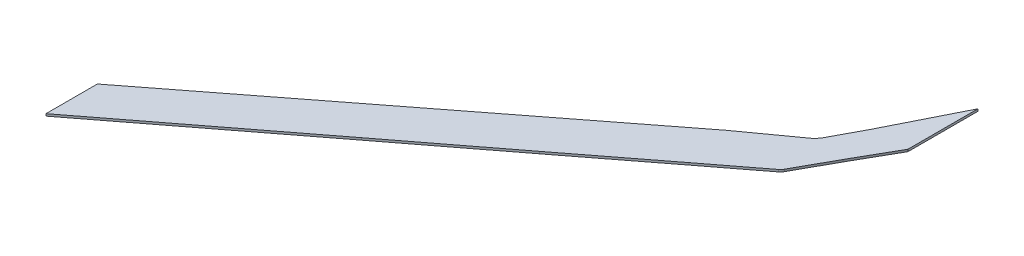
ISO-10303-21;
HEADER;
FILE_DESCRIPTION(('STEP AP214'),'2;1');
FILE_NAME('part.step','',(''),(''),'','','');
FILE_SCHEMA(('AUTOMOTIVE_DESIGN { 1 0 10303 214 1 1 1 1 }'));
ENDSEC;
DATA;
#1=APPLICATION_CONTEXT('core data for automotive mechanical design processes');
#2=APPLICATION_PROTOCOL_DEFINITION('international standard','automotive_design',2000,#1);
#3=PRODUCT_CONTEXT('',#1,'mechanical');
#4=PRODUCT('Part','Part','',(#3));
#5=PRODUCT_RELATED_PRODUCT_CATEGORY('part','',(#4));
#6=PRODUCT_DEFINITION_FORMATION('','',#4);
#7=PRODUCT_DEFINITION_CONTEXT('part definition',#1,'design');
#8=PRODUCT_DEFINITION('design','',#6,#7);
#9=PRODUCT_DEFINITION_SHAPE('','',#8);
#10=(LENGTH_UNIT() NAMED_UNIT(*) SI_UNIT(.MILLI.,.METRE.));
#11=(NAMED_UNIT(*) PLANE_ANGLE_UNIT() SI_UNIT($,.RADIAN.));
#12=(NAMED_UNIT(*) SI_UNIT($,.STERADIAN.) SOLID_ANGLE_UNIT());
#13=UNCERTAINTY_MEASURE_WITH_UNIT(LENGTH_MEASURE(1.E-05),#10,'distance_accuracy_value','');
#14=(GEOMETRIC_REPRESENTATION_CONTEXT(3) GLOBAL_UNCERTAINTY_ASSIGNED_CONTEXT((#13)) GLOBAL_UNIT_ASSIGNED_CONTEXT((#10,
#11,#12)) REPRESENTATION_CONTEXT('',''));
#15=CARTESIAN_POINT('',(0.,0.,0.));
#16=DIRECTION('',(0.,0.,1.));
#17=DIRECTION('',(1.,0.,0.));
#18=AXIS2_PLACEMENT_3D('',#15,#16,#17);
#19=CARTESIAN_POINT('',(835.042000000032,-839.999983,2312.319994));
#20=DIRECTION('',(-0.607742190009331,0.,-0.794134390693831));
#21=DIRECTION('',(-0.794134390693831,0.,0.607742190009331));
#22=AXIS2_PLACEMENT_3D('',#19,#20,#21);
#23=PLANE('',#22);
#24=DIRECTION('',(-0.794134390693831,0.,0.607742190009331));
#25=VECTOR('',#24,1.);
#26=CARTESIAN_POINT('',(835.042000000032,-829.999983,2312.319994));
#27=LINE('',#26,#25);
#28=CARTESIAN_POINT('',(1300.50802200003,-829.999983,1956.10404));
#29=VERTEX_POINT('',#28);
#30=CARTESIAN_POINT('',(835.042000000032,-829.999983,2312.319994));
#31=VERTEX_POINT('',#30);
#32=EDGE_CURVE('E215',#29,#31,#27,.T.);
#33=ORIENTED_EDGE('',*,*,#32,.T.);
#34=DIRECTION('',(0.,1.,0.));
#35=VECTOR('',#34,1.);
#36=CARTESIAN_POINT('',(835.042000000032,-839.999983,2312.319994));
#37=LINE('',#36,#35);
#38=CARTESIAN_POINT('',(835.042000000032,-839.999983,2312.319994));
#39=VERTEX_POINT('',#38);
#40=EDGE_CURVE('E197',#39,#31,#37,.T.);
#41=ORIENTED_EDGE('',*,*,#40,.F.);
#42=DIRECTION('',(-0.794134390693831,0.,0.607742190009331));
#43=VECTOR('',#42,1.);
#44=CARTESIAN_POINT('',(835.042000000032,-839.999983,2312.319994));
#45=LINE('',#44,#43);
#46=CARTESIAN_POINT('',(1300.50802200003,-839.999983,1956.10404));
#47=VERTEX_POINT('',#46);
#48=EDGE_CURVE('E203',#47,#39,#45,.T.);
#49=ORIENTED_EDGE('',*,*,#48,.F.);
#50=DIRECTION('',(0.,1.,0.));
#51=VECTOR('',#50,1.);
#52=CARTESIAN_POINT('',(1300.50802200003,-839.999983,1956.10404));
#53=LINE('',#52,#51);
#54=EDGE_CURVE('E291',#47,#29,#53,.T.);
#55=ORIENTED_EDGE('',*,*,#54,.T.);
#56=EDGE_LOOP('',(#33,#41,#49,#55));
#57=FACE_BOUND('',#56,.T.);
#58=ADVANCED_FACE('F39',(#57),#23,.F.);
#59=CARTESIAN_POINT('',(835.042000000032,-839.999983,2312.319994));
#60=DIRECTION('',(-0.608522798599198,0.,-0.793536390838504));
#61=DIRECTION('',(-0.793536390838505,0.,0.608522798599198));
#62=AXIS2_PLACEMENT_3D('',#59,#60,#61);
#63=PLANE('',#62);
#64=DIRECTION('',(-0.793536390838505,0.,0.608522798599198));
#65=VECTOR('',#64,1.);
#66=CARTESIAN_POINT('',(835.042000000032,-829.999983,2312.319994));
#67=LINE('',#66,#65);
#68=CARTESIAN_POINT('',(10.0010000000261,-829.999983,2945.00207900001));
#69=VERTEX_POINT('',#68);
#70=EDGE_CURVE('E293',#31,#69,#67,.T.);
#71=ORIENTED_EDGE('',*,*,#70,.T.);
#72=DIRECTION('',(0.,1.,0.));
#73=VECTOR('',#72,1.);
#74=CARTESIAN_POINT('',(10.0010000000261,-839.999983,2945.00207900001));
#75=LINE('',#74,#73);
#76=CARTESIAN_POINT('',(10.0010000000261,-839.999983,2945.00207900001));
#77=VERTEX_POINT('',#76);
#78=EDGE_CURVE('E200',#77,#69,#75,.T.);
#79=ORIENTED_EDGE('',*,*,#78,.F.);
#80=DIRECTION('',(-0.793536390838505,0.,0.608522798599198));
#81=VECTOR('',#80,1.);
#82=CARTESIAN_POINT('',(835.042000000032,-839.999983,2312.319994));
#83=LINE('',#82,#81);
#84=EDGE_CURVE('E193',#39,#77,#83,.T.);
#85=ORIENTED_EDGE('',*,*,#84,.F.);
#86=ORIENTED_EDGE('',*,*,#40,.T.);
#87=EDGE_LOOP('',(#71,#79,#85,#86));
#88=FACE_BOUND('',#87,.T.);
#89=ADVANCED_FACE('F195',(#88),#63,.F.);
#90=CARTESIAN_POINT('',(10.0040000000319,-839.999983,2707.895994));
#91=DIRECTION('',(0.999999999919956,0.,1.26525643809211E-05));
#92=DIRECTION('',(1.26525643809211E-05,0.,-0.999999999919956));
#93=AXIS2_PLACEMENT_3D('',#90,#91,#92);
#94=PLANE('',#93);
#95=DIRECTION('',(1.26525643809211E-05,0.,-0.999999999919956));
#96=VECTOR('',#95,1.);
#97=CARTESIAN_POINT('',(10.0040000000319,-829.999983,2707.895994));
#98=LINE('',#97,#96);
#99=CARTESIAN_POINT('',(10.0040000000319,-829.999983,2707.895994));
#100=VERTEX_POINT('',#99);
#101=EDGE_CURVE('E295',#69,#100,#98,.T.);
#102=ORIENTED_EDGE('',*,*,#101,.T.);
#103=DIRECTION('',(0.,1.,0.));
#104=VECTOR('',#103,1.);
#105=CARTESIAN_POINT('',(10.0040000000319,-839.999983,2707.895994));
#106=LINE('',#105,#104);
#107=CARTESIAN_POINT('',(10.0040000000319,-839.999983,2707.895994));
#108=VERTEX_POINT('',#107);
#109=EDGE_CURVE('E221',#108,#100,#106,.T.);
#110=ORIENTED_EDGE('',*,*,#109,.F.);
#111=DIRECTION('',(1.26525643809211E-05,0.,-0.999999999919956));
#112=VECTOR('',#111,1.);
#113=CARTESIAN_POINT('',(10.0040000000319,-839.999983,2707.895994));
#114=LINE('',#113,#112);
#115=EDGE_CURVE('E202',#77,#108,#114,.T.);
#116=ORIENTED_EDGE('',*,*,#115,.F.);
#117=ORIENTED_EDGE('',*,*,#78,.T.);
#118=EDGE_LOOP('',(#102,#110,#116,#117));
#119=FACE_BOUND('',#118,.T.);
#120=ADVANCED_FACE('F436',(#119),#94,.F.);
#121=CARTESIAN_POINT('',(1646.44897000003,-839.999983,1441.573024));
#122=DIRECTION('',(0.611991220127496,0.,0.790864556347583));
#123=DIRECTION('',(0.790864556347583,0.,-0.611991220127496));
#124=AXIS2_PLACEMENT_3D('',#121,#122,#123);
#125=PLANE('',#124);
#126=DIRECTION('',(0.790864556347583,0.,-0.611991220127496));
#127=VECTOR('',#126,1.);
#128=CARTESIAN_POINT('',(1646.44897000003,-829.999983,1441.573024));
#129=LINE('',#128,#127);
#130=CARTESIAN_POINT('',(1646.44897000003,-829.999983,1441.573024));
#131=VERTEX_POINT('',#130);
#132=EDGE_CURVE('E297',#100,#131,#129,.T.);
#133=ORIENTED_EDGE('',*,*,#132,.T.);
#134=DIRECTION('',(0.,1.,0.));
#135=VECTOR('',#134,1.);
#136=CARTESIAN_POINT('',(1646.44897000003,-839.999983,1441.573024));
#137=LINE('',#136,#135);
#138=CARTESIAN_POINT('',(1646.44897000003,-839.999983,1441.573024));
#139=VERTEX_POINT('',#138);
#140=EDGE_CURVE('E356',#139,#131,#137,.T.);
#141=ORIENTED_EDGE('',*,*,#140,.F.);
#142=DIRECTION('',(0.790864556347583,0.,-0.611991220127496));
#143=VECTOR('',#142,1.);
#144=CARTESIAN_POINT('',(1646.44897000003,-839.999983,1441.573024));
#145=LINE('',#144,#143);
#146=EDGE_CURVE('E365',#108,#139,#145,.T.);
#147=ORIENTED_EDGE('',*,*,#146,.F.);
#148=ORIENTED_EDGE('',*,*,#109,.T.);
#149=EDGE_LOOP('',(#133,#141,#147,#148));
#150=FACE_BOUND('',#149,.T.);
#151=ADVANCED_FACE('F363',(#150),#125,.F.);
#152=CARTESIAN_POINT('',(1871.30308200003,-839.999983,1279.76799));
#153=DIRECTION('',(0.584090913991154,0.,0.811688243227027));
#154=DIRECTION('',(0.811688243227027,0.,-0.584090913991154));
#155=AXIS2_PLACEMENT_3D('',#152,#153,#154);
#156=PLANE('',#155);
#157=DIRECTION('',(0.811688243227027,0.,-0.584090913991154));
#158=VECTOR('',#157,1.);
#159=CARTESIAN_POINT('',(1871.30308200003,-829.999983,1279.76799));
#160=LINE('',#159,#158);
#161=CARTESIAN_POINT('',(1871.19333740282,-829.999983,1279.84696221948));
#162=VERTEX_POINT('',#161);
#163=EDGE_CURVE('E299',#131,#162,#160,.T.);
#164=ORIENTED_EDGE('',*,*,#163,.T.);
#165=DIRECTION('',(0.,1.,0.));
#166=VECTOR('',#165,1.);
#167=CARTESIAN_POINT('',(1871.19333740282,-839.999983,1279.84696221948));
#168=LINE('',#167,#166);
#169=CARTESIAN_POINT('',(1871.19333740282,-839.999983,1279.84696221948));
#170=VERTEX_POINT('',#169);
#171=EDGE_CURVE('E219',#162,#170,#168,.F.);
#172=ORIENTED_EDGE('',*,*,#171,.T.);
#173=DIRECTION('',(0.811688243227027,0.,-0.584090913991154));
#174=VECTOR('',#173,1.);
#175=CARTESIAN_POINT('',(1871.30308200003,-839.999983,1279.76799));
#176=LINE('',#175,#174);
#177=EDGE_CURVE('E382',#139,#170,#176,.T.);
#178=ORIENTED_EDGE('',*,*,#177,.F.);
#179=ORIENTED_EDGE('',*,*,#140,.T.);
#180=EDGE_LOOP('',(#164,#172,#178,#179));
#181=FACE_BOUND('',#180,.T.);
#182=ADVANCED_FACE('F372',(#181),#156,.F.);
#183=CARTESIAN_POINT('',(1872.16115000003,-839.999983,1279.143453));
#184=DIRECTION('',(0.588472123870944,0.,0.808517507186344));
#185=DIRECTION('',(0.808517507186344,0.,-0.588472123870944));
#186=AXIS2_PLACEMENT_3D('',#183,#184,#185);
#187=PLANE('',#186);
#188=DIRECTION('',(0.808517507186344,0.,-0.588472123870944));
#189=VECTOR('',#188,1.);
#190=CARTESIAN_POINT('',(1872.16115000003,-839.999983,1279.143453));
#191=LINE('',#190,#189);
#192=CARTESIAN_POINT('',(1871.41239789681,-839.999983,1279.68842541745));
#193=VERTEX_POINT('',#192);
#194=CARTESIAN_POINT('',(1872.16115000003,-839.999983,1279.143453));
#195=VERTEX_POINT('',#194);
#196=EDGE_CURVE('E380',#193,#195,#191,.T.);
#197=ORIENTED_EDGE('',*,*,#196,.F.);
#198=DIRECTION('',(0.,1.,0.));
#199=VECTOR('',#198,1.);
#200=CARTESIAN_POINT('',(1871.41239789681,-829.999983,1279.68842541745));
#201=LINE('',#200,#199);
#202=CARTESIAN_POINT('',(1871.41239789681,-829.999983,1279.68842541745));
#203=VERTEX_POINT('',#202);
#204=EDGE_CURVE('E216',#193,#203,#201,.T.);
#205=ORIENTED_EDGE('',*,*,#204,.T.);
#206=DIRECTION('',(0.808517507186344,0.,-0.588472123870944));
#207=VECTOR('',#206,1.);
#208=CARTESIAN_POINT('',(1872.16115000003,-829.999983,1279.143453));
#209=LINE('',#208,#207);
#210=CARTESIAN_POINT('',(1872.16115000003,-829.999983,1279.143453));
#211=VERTEX_POINT('',#210);
#212=EDGE_CURVE('E302',#203,#211,#209,.T.);
#213=ORIENTED_EDGE('',*,*,#212,.T.);
#214=DIRECTION('',(0.,1.,0.));
#215=VECTOR('',#214,1.);
#216=CARTESIAN_POINT('',(1872.16115000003,-839.999983,1279.143453));
#217=LINE('',#216,#215);
#218=EDGE_CURVE('E353',#195,#211,#217,.T.);
#219=ORIENTED_EDGE('',*,*,#218,.F.);
#220=EDGE_LOOP('',(#197,#205,#213,#219));
#221=FACE_BOUND('',#220,.T.);
#222=ADVANCED_FACE('F384',(#221),#187,.F.);
#223=CARTESIAN_POINT('',(1873.01254300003,-839.999983,1278.509974));
#224=DIRECTION('',(0.596940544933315,0.,0.802285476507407));
#225=DIRECTION('',(0.802285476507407,0.,-0.596940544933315));
#226=AXIS2_PLACEMENT_3D('',#223,#224,#225);
#227=PLANE('',#226);
#228=DIRECTION('',(0.802285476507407,0.,-0.596940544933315));
#229=VECTOR('',#228,1.);
#230=CARTESIAN_POINT('',(1873.01254300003,-829.999983,1278.509974));
#231=LINE('',#230,#229);
#232=CARTESIAN_POINT('',(1873.01254300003,-829.999983,1278.509974));
#233=VERTEX_POINT('',#232);
#234=EDGE_CURVE('E304',#211,#233,#231,.T.);
#235=ORIENTED_EDGE('',*,*,#234,.T.);
#236=DIRECTION('',(0.,1.,0.));
#237=VECTOR('',#236,1.);
#238=CARTESIAN_POINT('',(1873.01254300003,-839.999983,1278.509974));
#239=LINE('',#238,#237);
#240=CARTESIAN_POINT('',(1873.01254300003,-839.999983,1278.509974));
#241=VERTEX_POINT('',#240);
#242=EDGE_CURVE('E350',#241,#233,#239,.T.);
#243=ORIENTED_EDGE('',*,*,#242,.F.);
#244=DIRECTION('',(0.802285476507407,0.,-0.596940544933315));
#245=VECTOR('',#244,1.);
#246=CARTESIAN_POINT('',(1873.01254300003,-839.999983,1278.509974));
#247=LINE('',#246,#245);
#248=EDGE_CURVE('E386',#195,#241,#247,.T.);
#249=ORIENTED_EDGE('',*,*,#248,.F.);
#250=ORIENTED_EDGE('',*,*,#218,.T.);
#251=EDGE_LOOP('',(#235,#243,#249,#250));
#252=FACE_BOUND('',#251,.T.);
#253=ADVANCED_FACE('F422',(#252),#227,.F.);
#254=CARTESIAN_POINT('',(1873.85726000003,-839.999983,1277.867436));
#255=DIRECTION('',(0.605413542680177,0.,0.795911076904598));
#256=DIRECTION('',(0.795911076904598,0.,-0.605413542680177));
#257=AXIS2_PLACEMENT_3D('',#254,#255,#256);
#258=PLANE('',#257);
#259=DIRECTION('',(0.795911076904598,0.,-0.605413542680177));
#260=VECTOR('',#259,1.);
#261=CARTESIAN_POINT('',(1873.85726000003,-829.999983,1277.867436));
#262=LINE('',#261,#260);
#263=CARTESIAN_POINT('',(1873.85726000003,-829.999983,1277.867436));
#264=VERTEX_POINT('',#263);
#265=EDGE_CURVE('E306',#233,#264,#262,.T.);
#266=ORIENTED_EDGE('',*,*,#265,.T.);
#267=DIRECTION('',(0.,1.,0.));
#268=VECTOR('',#267,1.);
#269=CARTESIAN_POINT('',(1873.85726000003,-839.999983,1277.867436));
#270=LINE('',#269,#268);
#271=CARTESIAN_POINT('',(1873.85726000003,-839.999983,1277.867436));
#272=VERTEX_POINT('',#271);
#273=EDGE_CURVE('E347',#272,#264,#270,.T.);
#274=ORIENTED_EDGE('',*,*,#273,.F.);
#275=DIRECTION('',(0.795911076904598,0.,-0.605413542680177));
#276=VECTOR('',#275,1.);
#277=CARTESIAN_POINT('',(1873.85726000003,-839.999983,1277.867436));
#278=LINE('',#277,#276);
#279=EDGE_CURVE('E388',#241,#272,#278,.T.);
#280=ORIENTED_EDGE('',*,*,#279,.F.);
#281=ORIENTED_EDGE('',*,*,#242,.T.);
#282=EDGE_LOOP('',(#266,#274,#280,#281));
#283=FACE_BOUND('',#282,.T.);
#284=ADVANCED_FACE('F418',(#283),#258,.F.);
#285=CARTESIAN_POINT('',(1873.85726000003,-839.999983,1277.867436));
#286=DIRECTION('',(0.662845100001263,0.,0.748756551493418));
#287=DIRECTION('',(0.748756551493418,0.,-0.662845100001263));
#288=AXIS2_PLACEMENT_3D('',#285,#286,#287);
#289=PLANE('',#288);
#290=DIRECTION('',(0.748756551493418,0.,-0.662845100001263));
#291=VECTOR('',#290,1.);
#292=CARTESIAN_POINT('',(1873.85726000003,-829.999983,1277.867436));
#293=LINE('',#292,#291);
#294=CARTESIAN_POINT('',(1881.59287088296,-829.999983,1271.01940006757));
#295=VERTEX_POINT('',#294);
#296=EDGE_CURVE('E308',#264,#295,#293,.T.);
#297=ORIENTED_EDGE('',*,*,#296,.T.);
#298=DIRECTION('',(0.,1.,0.));
#299=VECTOR('',#298,1.);
#300=CARTESIAN_POINT('',(1881.59287088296,-839.999983,1271.01940006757));
#301=LINE('',#300,#299);
#302=CARTESIAN_POINT('',(1881.59287088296,-839.999983,1271.01940006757));
#303=VERTEX_POINT('',#302);
#304=EDGE_CURVE('E231',#295,#303,#301,.F.);
#305=ORIENTED_EDGE('',*,*,#304,.T.);
#306=DIRECTION('',(0.748756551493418,0.,-0.662845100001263));
#307=VECTOR('',#306,1.);
#308=CARTESIAN_POINT('',(1873.85726000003,-839.999983,1277.867436));
#309=LINE('',#308,#307);
#310=EDGE_CURVE('E394',#272,#303,#309,.T.);
#311=ORIENTED_EDGE('',*,*,#310,.F.);
#312=ORIENTED_EDGE('',*,*,#273,.T.);
#313=EDGE_LOOP('',(#297,#305,#311,#312));
#314=FACE_BOUND('',#313,.T.);
#315=ADVANCED_FACE('F413',(#314),#289,.F.);
#316=CARTESIAN_POINT('',(1893.14675300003,-839.999983,1258.259296));
#317=DIRECTION('',(0.759515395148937,0.,0.65048932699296));
#318=DIRECTION('',(0.65048932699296,0.,-0.759515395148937));
#319=AXIS2_PLACEMENT_3D('',#316,#317,#318);
#320=PLANE('',#319);
#321=DIRECTION('',(0.65048932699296,0.,-0.759515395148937));
#322=VECTOR('',#321,1.);
#323=CARTESIAN_POINT('',(1893.14675300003,-839.999983,1258.259296));
#324=LINE('',#323,#322);
#325=CARTESIAN_POINT('',(1886.42638564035,-839.999983,1266.10603884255));
#326=VERTEX_POINT('',#325);
#327=CARTESIAN_POINT('',(1890.89949238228,-839.999983,1260.88321151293));
#328=VERTEX_POINT('',#327);
#329=EDGE_CURVE('E277',#326,#328,#324,.T.);
#330=ORIENTED_EDGE('',*,*,#329,.F.);
#331=DIRECTION('',(0.,1.,0.));
#332=VECTOR('',#331,1.);
#333=CARTESIAN_POINT('',(1886.42638564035,-829.999983,1266.10603884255));
#334=LINE('',#333,#332);
#335=CARTESIAN_POINT('',(1886.42638564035,-829.999983,1266.10603884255));
#336=VERTEX_POINT('',#335);
#337=EDGE_CURVE('E228',#326,#336,#334,.T.);
#338=ORIENTED_EDGE('',*,*,#337,.T.);
#339=DIRECTION('',(0.65048932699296,0.,-0.759515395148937));
#340=VECTOR('',#339,1.);
#341=CARTESIAN_POINT('',(1893.14675300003,-829.999983,1258.259296));
#342=LINE('',#341,#340);
#343=CARTESIAN_POINT('',(1890.89949238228,-829.999983,1260.88321151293));
#344=VERTEX_POINT('',#343);
#345=EDGE_CURVE('E263',#336,#344,#342,.T.);
#346=ORIENTED_EDGE('',*,*,#345,.T.);
#347=DIRECTION('',(0.,1.,0.));
#348=VECTOR('',#347,1.);
#349=CARTESIAN_POINT('',(1890.89949238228,-839.999983,1260.88321151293));
#350=LINE('',#349,#348);
#351=EDGE_CURVE('E226',#344,#328,#350,.F.);
#352=ORIENTED_EDGE('',*,*,#351,.T.);
#353=EDGE_LOOP('',(#330,#338,#346,#352));
#354=FACE_BOUND('',#353,.T.);
#355=ADVANCED_FACE('F406',(#354),#320,.F.);
#356=CARTESIAN_POINT('',(1900.58898900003,-839.999983,1246.654987));
#357=DIRECTION('',(0.841761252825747,0.,0.539849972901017));
#358=DIRECTION('',(0.539849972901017,0.,-0.841761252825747));
#359=AXIS2_PLACEMENT_3D('',#356,#357,#358);
#360=PLANE('',#359);
#361=DIRECTION('',(0.539849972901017,0.,-0.841761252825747));
#362=VECTOR('',#361,1.);
#363=CARTESIAN_POINT('',(1900.58898900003,-839.999983,1246.654987));
#364=LINE('',#363,#362);
#365=CARTESIAN_POINT('',(1895.01178526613,-839.999983,1255.35124380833));
#366=VERTEX_POINT('',#365);
#367=CARTESIAN_POINT('',(1899.51471182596,-839.999983,1248.330054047));
#368=VERTEX_POINT('',#367);
#369=EDGE_CURVE('E273',#366,#368,#364,.T.);
#370=ORIENTED_EDGE('',*,*,#369,.F.);
#371=DIRECTION('',(0.,1.,0.));
#372=VECTOR('',#371,1.);
#373=CARTESIAN_POINT('',(1895.01178526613,-829.999983,1255.35124380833));
#374=LINE('',#373,#372);
#375=CARTESIAN_POINT('',(1895.01178526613,-829.999983,1255.35124380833));
#376=VERTEX_POINT('',#375);
#377=EDGE_CURVE('E235',#366,#376,#374,.T.);
#378=ORIENTED_EDGE('',*,*,#377,.T.);
#379=DIRECTION('',(0.539849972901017,0.,-0.841761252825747));
#380=VECTOR('',#379,1.);
#381=CARTESIAN_POINT('',(1900.58898900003,-829.999983,1246.654987));
#382=LINE('',#381,#380);
#383=CARTESIAN_POINT('',(1899.51471182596,-829.999983,1248.330054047));
#384=VERTEX_POINT('',#383);
#385=EDGE_CURVE('E256',#376,#384,#382,.T.);
#386=ORIENTED_EDGE('',*,*,#385,.T.);
#387=DIRECTION('',(0.,1.,0.));
#388=VECTOR('',#387,1.);
#389=CARTESIAN_POINT('',(1899.51471182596,-839.999983,1248.330054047));
#390=LINE('',#389,#388);
#391=EDGE_CURVE('E233',#384,#368,#390,.F.);
#392=ORIENTED_EDGE('',*,*,#391,.T.);
#393=EDGE_LOOP('',(#370,#378,#386,#392));
#394=FACE_BOUND('',#393,.T.);
#395=ADVANCED_FACE('F261',(#394),#360,.F.);
#396=CARTESIAN_POINT('',(1975.71277600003,-839.999983,1106.050372));
#397=DIRECTION('',(0.882001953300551,0.,0.471245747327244));
#398=DIRECTION('',(0.471245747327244,0.,-0.882001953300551));
#399=AXIS2_PLACEMENT_3D('',#396,#397,#398);
#400=PLANE('',#399);
#401=DIRECTION('',(0.471245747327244,0.,-0.882001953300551));
#402=VECTOR('',#401,1.);
#403=CARTESIAN_POINT('',(1975.71277600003,-839.999983,1106.050372));
#404=LINE('',#403,#402);
#405=CARTESIAN_POINT('',(1901.5267468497,-839.999983,1244.89984276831));
#406=VERTEX_POINT('',#405);
#407=CARTESIAN_POINT('',(1975.71277600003,-839.999983,1106.050372));
#408=VERTEX_POINT('',#407);
#409=EDGE_CURVE('E269',#406,#408,#404,.T.);
#410=ORIENTED_EDGE('',*,*,#409,.F.);
#411=DIRECTION('',(0.,1.,0.));
#412=VECTOR('',#411,1.);
#413=CARTESIAN_POINT('',(1901.5267468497,-829.999983,1244.89984276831));
#414=LINE('',#413,#412);
#415=CARTESIAN_POINT('',(1901.5267468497,-829.999983,1244.89984276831));
#416=VERTEX_POINT('',#415);
#417=EDGE_CURVE('E238',#406,#416,#414,.T.);
#418=ORIENTED_EDGE('',*,*,#417,.T.);
#419=DIRECTION('',(0.471245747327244,0.,-0.882001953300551));
#420=VECTOR('',#419,1.);
#421=CARTESIAN_POINT('',(1975.71277600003,-829.999983,1106.050372));
#422=LINE('',#421,#420);
#423=CARTESIAN_POINT('',(1975.71277600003,-829.999983,1106.050372));
#424=VERTEX_POINT('',#423);
#425=EDGE_CURVE('E258',#416,#424,#422,.T.);
#426=ORIENTED_EDGE('',*,*,#425,.T.);
#427=DIRECTION('',(0.,1.,0.));
#428=VECTOR('',#427,1.);
#429=CARTESIAN_POINT('',(1975.71277600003,-839.999983,1106.050372));
#430=LINE('',#429,#428);
#431=EDGE_CURVE('E270',#408,#424,#430,.T.);
#432=ORIENTED_EDGE('',*,*,#431,.F.);
#433=EDGE_LOOP('',(#410,#418,#426,#432));
#434=FACE_BOUND('',#433,.T.);
#435=ADVANCED_FACE('F266',(#434),#400,.F.);
#436=CARTESIAN_POINT('',(2142.00305899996,-839.999983,774.038136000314));
#437=DIRECTION('',(0.894120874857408,0.,0.44782570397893));
#438=DIRECTION('',(0.44782570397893,0.,-0.894120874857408));
#439=AXIS2_PLACEMENT_3D('',#436,#437,#438);
#440=PLANE('',#439);
#441=DIRECTION('',(0.44782570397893,0.,-0.894120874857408));
#442=VECTOR('',#441,1.);
#443=CARTESIAN_POINT('',(2142.00305899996,-829.999983,774.038136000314));
#444=LINE('',#443,#442);
#445=CARTESIAN_POINT('',(2142.00305899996,-829.999983,774.038136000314));
#446=VERTEX_POINT('',#445);
#447=EDGE_CURVE('E314',#424,#446,#444,.T.);
#448=ORIENTED_EDGE('',*,*,#447,.T.);
#449=DIRECTION('',(0.,1.,0.));
#450=VECTOR('',#449,1.);
#451=CARTESIAN_POINT('',(2142.00305899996,-839.999983,774.038136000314));
#452=LINE('',#451,#450);
#453=CARTESIAN_POINT('',(2142.00305899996,-839.999983,774.038136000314));
#454=VERTEX_POINT('',#453);
#455=EDGE_CURVE('E343',#454,#446,#452,.T.);
#456=ORIENTED_EDGE('',*,*,#455,.F.);
#457=DIRECTION('',(0.44782570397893,0.,-0.894120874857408));
#458=VECTOR('',#457,1.);
#459=CARTESIAN_POINT('',(2142.00305899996,-839.999983,774.038136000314));
#460=LINE('',#459,#458);
#461=EDGE_CURVE('E272',#408,#454,#460,.T.);
#462=ORIENTED_EDGE('',*,*,#461,.F.);
#463=ORIENTED_EDGE('',*,*,#431,.T.);
#464=EDGE_LOOP('',(#448,#456,#462,#463));
#465=FACE_BOUND('',#464,.T.);
#466=ADVANCED_FACE('F493',(#465),#440,.F.);
#467=CARTESIAN_POINT('',(2142.00305899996,-839.999983,1097.29597160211));
#468=DIRECTION('',(-1.,0.,0.));
#469=DIRECTION('',(0.,0.,1.));
#470=AXIS2_PLACEMENT_3D('',#467,#468,#469);
#471=PLANE('',#470);
#472=DIRECTION('',(0.,0.,1.));
#473=VECTOR('',#472,1.);
#474=CARTESIAN_POINT('',(2142.00305899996,-829.999983,1097.29597160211));
#475=LINE('',#474,#473);
#476=CARTESIAN_POINT('',(2142.00305899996,-829.999983,1097.29597160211));
#477=VERTEX_POINT('',#476);
#478=EDGE_CURVE('E316',#446,#477,#475,.T.);
#479=ORIENTED_EDGE('',*,*,#478,.T.);
#480=DIRECTION('',(0.,1.,0.));
#481=VECTOR('',#480,1.);
#482=CARTESIAN_POINT('',(2142.00305899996,-839.999983,1097.29597160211));
#483=LINE('',#482,#481);
#484=CARTESIAN_POINT('',(2142.00305899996,-839.999983,1097.29597160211));
#485=VERTEX_POINT('',#484);
#486=EDGE_CURVE('E340',#485,#477,#483,.T.);
#487=ORIENTED_EDGE('',*,*,#486,.F.);
#488=DIRECTION('',(0.,0.,1.));
#489=VECTOR('',#488,1.);
#490=CARTESIAN_POINT('',(2142.00305899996,-839.999983,1097.29597160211));
#491=LINE('',#490,#489);
#492=EDGE_CURVE('E275',#454,#485,#491,.T.);
#493=ORIENTED_EDGE('',*,*,#492,.F.);
#494=ORIENTED_EDGE('',*,*,#455,.T.);
#495=EDGE_LOOP('',(#479,#487,#493,#494));
#496=FACE_BOUND('',#495,.T.);
#497=ADVANCED_FACE('F584',(#496),#471,.F.);
#498=CARTESIAN_POINT('',(2142.00305899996,-839.999983,1097.29597160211));
#499=DIRECTION('',(-0.868908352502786,0.,-0.494973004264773));
#500=DIRECTION('',(-0.494973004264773,0.,0.868908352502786));
#501=AXIS2_PLACEMENT_3D('',#498,#499,#500);
#502=PLANE('',#501);
#503=DIRECTION('',(-0.494973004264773,0.,0.868908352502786));
#504=VECTOR('',#503,1.);
#505=CARTESIAN_POINT('',(2142.00305899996,-829.999983,1097.29597160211));
#506=LINE('',#505,#504);
#507=CARTESIAN_POINT('',(2033.11801000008,-829.999983,1288.439989));
#508=VERTEX_POINT('',#507);
#509=EDGE_CURVE('E318',#477,#508,#506,.T.);
#510=ORIENTED_EDGE('',*,*,#509,.T.);
#511=DIRECTION('',(0.,1.,0.));
#512=VECTOR('',#511,1.);
#513=CARTESIAN_POINT('',(2033.11801000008,-839.999983,1288.439989));
#514=LINE('',#513,#512);
#515=CARTESIAN_POINT('',(2033.11801000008,-839.999983,1288.439989));
#516=VERTEX_POINT('',#515);
#517=EDGE_CURVE('E337',#516,#508,#514,.T.);
#518=ORIENTED_EDGE('',*,*,#517,.F.);
#519=DIRECTION('',(-0.494973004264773,0.,0.868908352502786));
#520=VECTOR('',#519,1.);
#521=CARTESIAN_POINT('',(2142.00305899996,-839.999983,1097.29597160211));
#522=LINE('',#521,#520);
#523=EDGE_CURVE('E282',#485,#516,#522,.T.);
#524=ORIENTED_EDGE('',*,*,#523,.F.);
#525=ORIENTED_EDGE('',*,*,#486,.T.);
#526=EDGE_LOOP('',(#510,#518,#524,#525));
#527=FACE_BOUND('',#526,.T.);
#528=ADVANCED_FACE('F574',(#527),#502,.F.);
#529=CARTESIAN_POINT('',(1936.96451200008,-839.999983,1462.149501));
#530=DIRECTION('',(-0.87490841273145,0.,-0.484288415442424));
#531=DIRECTION('',(-0.484288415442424,0.,0.87490841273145));
#532=AXIS2_PLACEMENT_3D('',#529,#530,#531);
#533=PLANE('',#532);
#534=DIRECTION('',(-0.484288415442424,0.,0.87490841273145));
#535=VECTOR('',#534,1.);
#536=CARTESIAN_POINT('',(1936.96451200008,-829.999983,1462.149501));
#537=LINE('',#536,#535);
#538=CARTESIAN_POINT('',(1936.96451200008,-829.999983,1462.149501));
#539=VERTEX_POINT('',#538);
#540=EDGE_CURVE('E320',#508,#539,#537,.T.);
#541=ORIENTED_EDGE('',*,*,#540,.T.);
#542=DIRECTION('',(0.,1.,0.));
#543=VECTOR('',#542,1.);
#544=CARTESIAN_POINT('',(1936.96451200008,-839.999983,1462.149501));
#545=LINE('',#544,#543);
#546=CARTESIAN_POINT('',(1936.96451200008,-839.999983,1462.149501));
#547=VERTEX_POINT('',#546);
#548=EDGE_CURVE('E334',#547,#539,#545,.T.);
#549=ORIENTED_EDGE('',*,*,#548,.F.);
#550=DIRECTION('',(-0.484288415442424,0.,0.87490841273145));
#551=VECTOR('',#550,1.);
#552=CARTESIAN_POINT('',(1936.96451200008,-839.999983,1462.149501));
#553=LINE('',#552,#551);
#554=EDGE_CURVE('E284',#516,#547,#553,.T.);
#555=ORIENTED_EDGE('',*,*,#554,.F.);
#556=ORIENTED_EDGE('',*,*,#517,.T.);
#557=EDGE_LOOP('',(#541,#549,#555,#556));
#558=FACE_BOUND('',#557,.T.);
#559=ADVANCED_FACE('F564',(#558),#533,.F.);
#560=CARTESIAN_POINT('',(1893.22360580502,-839.999983,1437.92352442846));
#561=DIRECTION('',(0.,1.,0.));
#562=DIRECTION('',(0.,0.,1.));
#563=AXIS2_PLACEMENT_3D('',#560,#561,#562);
#564=CYLINDRICAL_SURFACE('',#563,50.0016481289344);
#565=CARTESIAN_POINT('',(1893.22360580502,-829.999983,1437.92352442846));
#566=DIRECTION('',(0.,-1.,0.));
#567=DIRECTION('',(0.,0.,-1.));
#568=AXIS2_PLACEMENT_3D('',#565,#566,#567);
#569=CIRCLE('',#568,50.0016481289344);
#570=CARTESIAN_POINT('',(1923.62773400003,-829.999983,1477.61929));
#571=VERTEX_POINT('',#570);
#572=EDGE_CURVE('E322',#539,#571,#569,.T.);
#573=ORIENTED_EDGE('',*,*,#572,.T.);
#574=DIRECTION('',(0.,1.,0.));
#575=VECTOR('',#574,1.);
#576=CARTESIAN_POINT('',(1923.62773400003,-839.999983,1477.61929));
#577=LINE('',#576,#575);
#578=CARTESIAN_POINT('',(1923.62773400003,-839.999983,1477.61929));
#579=VERTEX_POINT('',#578);
#580=EDGE_CURVE('E331',#579,#571,#577,.T.);
#581=ORIENTED_EDGE('',*,*,#580,.F.);
#582=CARTESIAN_POINT('',(1893.22360580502,-839.999983,1437.92352442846));
#583=DIRECTION('',(0.,-1.,0.));
#584=DIRECTION('',(0.,0.,-1.));
#585=AXIS2_PLACEMENT_3D('',#582,#583,#584);
#586=CIRCLE('',#585,50.0016481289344);
#587=EDGE_CURVE('E286',#547,#579,#586,.T.);
#588=ORIENTED_EDGE('',*,*,#587,.F.);
#589=ORIENTED_EDGE('',*,*,#548,.T.);
#590=EDGE_LOOP('',(#573,#581,#588,#589));
#591=FACE_BOUND('',#590,.T.);
#592=ADVANCED_FACE('F554',(#591),#564,.T.);
#593=CARTESIAN_POINT('',(1923.62773400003,-839.999983,1477.61929));
#594=DIRECTION('',(-0.608057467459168,0.,-0.793893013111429));
#595=DIRECTION('',(-0.793893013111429,0.,0.608057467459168));
#596=AXIS2_PLACEMENT_3D('',#593,#594,#595);
#597=PLANE('',#596);
#598=DIRECTION('',(-0.793893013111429,0.,0.608057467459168));
#599=VECTOR('',#598,1.);
#600=CARTESIAN_POINT('',(1923.62773400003,-829.999983,1477.61929));
#601=LINE('',#600,#599);
#602=CARTESIAN_POINT('',(1690.02103800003,-829.999983,1656.543016));
#603=VERTEX_POINT('',#602);
#604=EDGE_CURVE('E324',#571,#603,#601,.T.);
#605=ORIENTED_EDGE('',*,*,#604,.T.);
#606=DIRECTION('',(0.,1.,0.));
#607=VECTOR('',#606,1.);
#608=CARTESIAN_POINT('',(1690.02103800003,-839.999983,1656.543016));
#609=LINE('',#608,#607);
#610=CARTESIAN_POINT('',(1690.02103800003,-839.999983,1656.543016));
#611=VERTEX_POINT('',#610);
#612=EDGE_CURVE('E328',#611,#603,#609,.T.);
#613=ORIENTED_EDGE('',*,*,#612,.F.);
#614=DIRECTION('',(-0.793893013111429,0.,0.608057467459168));
#615=VECTOR('',#614,1.);
#616=CARTESIAN_POINT('',(1923.62773400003,-839.999983,1477.61929));
#617=LINE('',#616,#615);
#618=EDGE_CURVE('E288',#579,#611,#617,.T.);
#619=ORIENTED_EDGE('',*,*,#618,.F.);
#620=ORIENTED_EDGE('',*,*,#580,.T.);
#621=EDGE_LOOP('',(#605,#613,#619,#620));
#622=FACE_BOUND('',#621,.T.);
#623=ADVANCED_FACE('F544',(#622),#597,.F.);
#624=CARTESIAN_POINT('',(1690.02103800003,-839.999983,1656.543016));
#625=DIRECTION('',(-0.60962845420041,0.,-0.792687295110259));
#626=DIRECTION('',(-0.792687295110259,0.,0.60962845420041));
#627=AXIS2_PLACEMENT_3D('',#624,#625,#626);
#628=PLANE('',#627);
#629=DIRECTION('',(-0.792687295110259,0.,0.60962845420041));
#630=VECTOR('',#629,1.);
#631=CARTESIAN_POINT('',(1690.02103800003,-829.999983,1656.543016));
#632=LINE('',#631,#630);
#633=EDGE_CURVE('E212',#603,#29,#632,.T.);
#634=ORIENTED_EDGE('',*,*,#633,.T.);
#635=ORIENTED_EDGE('',*,*,#54,.F.);
#636=DIRECTION('',(-0.792687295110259,0.,0.60962845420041));
#637=VECTOR('',#636,1.);
#638=CARTESIAN_POINT('',(1690.02103800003,-839.999983,1656.543016));
#639=LINE('',#638,#637);
#640=EDGE_CURVE('E208',#611,#47,#639,.T.);
#641=ORIENTED_EDGE('',*,*,#640,.F.);
#642=ORIENTED_EDGE('',*,*,#612,.T.);
#643=EDGE_LOOP('',(#634,#635,#641,#642));
#644=FACE_BOUND('',#643,.T.);
#645=ADVANCED_FACE('F482',(#644),#628,.F.);
#646=CARTESIAN_POINT('',(1893.22360580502,-839.999983,1437.92352442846));
#647=DIRECTION('',(0.,-1.,0.));
#648=DIRECTION('',(0.,0.,-1.));
#649=AXIS2_PLACEMENT_3D('',#646,#647,#648);
#650=PLANE('',#649);
#651=ORIENTED_EDGE('',*,*,#48,.T.);
#652=ORIENTED_EDGE('',*,*,#84,.T.);
#653=ORIENTED_EDGE('',*,*,#115,.T.);
#654=ORIENTED_EDGE('',*,*,#146,.T.);
#655=ORIENTED_EDGE('',*,*,#177,.T.);
#656=CARTESIAN_POINT('',(1841.98879170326,-839.999983,1239.26255005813));
#657=DIRECTION('',(0.,-1.,0.));
#658=DIRECTION('',(0.,0.,-1.));
#659=AXIS2_PLACEMENT_3D('',#656,#657,#658);
#660=CIRCLE('',#659,50.);
#661=EDGE_CURVE('E242',#170,#193,#660,.F.);
#662=ORIENTED_EDGE('',*,*,#661,.T.);
#663=ORIENTED_EDGE('',*,*,#196,.T.);
#664=ORIENTED_EDGE('',*,*,#248,.T.);
#665=ORIENTED_EDGE('',*,*,#279,.T.);
#666=ORIENTED_EDGE('',*,*,#310,.T.);
#667=CARTESIAN_POINT('',(1848.4506158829,-839.999983,1233.5815724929));
#668=DIRECTION('',(0.,-1.,0.));
#669=DIRECTION('',(0.,0.,-1.));
#670=AXIS2_PLACEMENT_3D('',#667,#668,#669);
#671=CIRCLE('',#670,50.);
#672=EDGE_CURVE('E246',#303,#326,#671,.F.);
#673=ORIENTED_EDGE('',*,*,#672,.T.);
#674=ORIENTED_EDGE('',*,*,#329,.T.);
#675=CARTESIAN_POINT('',(1852.92372262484,-839.999983,1228.35874516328));
#676=DIRECTION('',(0.,-1.,0.));
#677=DIRECTION('',(0.,0.,-1.));
#678=AXIS2_PLACEMENT_3D('',#675,#676,#677);
#679=CIRCLE('',#678,50.);
#680=EDGE_CURVE('E250',#328,#366,#679,.F.);
#681=ORIENTED_EDGE('',*,*,#680,.T.);
#682=ORIENTED_EDGE('',*,*,#369,.T.);
#683=CARTESIAN_POINT('',(1857.42664918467,-839.999983,1221.33755540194));
#684=DIRECTION('',(0.,-1.,0.));
#685=DIRECTION('',(0.,0.,-1.));
#686=AXIS2_PLACEMENT_3D('',#683,#684,#685);
#687=CIRCLE('',#686,50.);
#688=EDGE_CURVE('E11',#368,#406,#687,.F.);
#689=ORIENTED_EDGE('',*,*,#688,.T.);
#690=ORIENTED_EDGE('',*,*,#409,.T.);
#691=ORIENTED_EDGE('',*,*,#461,.T.);
#692=ORIENTED_EDGE('',*,*,#492,.T.);
#693=ORIENTED_EDGE('',*,*,#523,.T.);
#694=ORIENTED_EDGE('',*,*,#554,.T.);
#695=ORIENTED_EDGE('',*,*,#587,.T.);
#696=ORIENTED_EDGE('',*,*,#618,.T.);
#697=ORIENTED_EDGE('',*,*,#640,.T.);
#698=EDGE_LOOP('',(#651,#652,#653,#654,#655,#662,#663,#664,#665,#666,#673,#674,#681,#682,#689,
#690,#691,#692,#693,#694,#695,#696,#697));
#699=FACE_BOUND('',#698,.T.);
#700=ADVANCED_FACE('F206',(#699),#650,.T.);
#701=CARTESIAN_POINT('',(1893.22360580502,-829.999983,1437.92352442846));
#702=DIRECTION('',(0.,-1.,0.));
#703=DIRECTION('',(0.,0.,-1.));
#704=AXIS2_PLACEMENT_3D('',#701,#702,#703);
#705=PLANE('',#704);
#706=ORIENTED_EDGE('',*,*,#32,.F.);
#707=ORIENTED_EDGE('',*,*,#633,.F.);
#708=ORIENTED_EDGE('',*,*,#604,.F.);
#709=ORIENTED_EDGE('',*,*,#572,.F.);
#710=ORIENTED_EDGE('',*,*,#540,.F.);
#711=ORIENTED_EDGE('',*,*,#509,.F.);
#712=ORIENTED_EDGE('',*,*,#478,.F.);
#713=ORIENTED_EDGE('',*,*,#447,.F.);
#714=ORIENTED_EDGE('',*,*,#425,.F.);
#715=CARTESIAN_POINT('',(1857.42664918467,-829.999983,1221.33755540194));
#716=DIRECTION('',(0.,-1.,0.));
#717=DIRECTION('',(0.,0.,-1.));
#718=AXIS2_PLACEMENT_3D('',#715,#716,#717);
#719=CIRCLE('',#718,50.);
#720=EDGE_CURVE('E47',#416,#384,#719,.T.);
#721=ORIENTED_EDGE('',*,*,#720,.T.);
#722=ORIENTED_EDGE('',*,*,#385,.F.);
#723=CARTESIAN_POINT('',(1852.92372262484,-829.999983,1228.35874516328));
#724=DIRECTION('',(0.,-1.,0.));
#725=DIRECTION('',(0.,0.,-1.));
#726=AXIS2_PLACEMENT_3D('',#723,#724,#725);
#727=CIRCLE('',#726,50.);
#728=EDGE_CURVE('E248',#376,#344,#727,.T.);
#729=ORIENTED_EDGE('',*,*,#728,.T.);
#730=ORIENTED_EDGE('',*,*,#345,.F.);
#731=CARTESIAN_POINT('',(1848.4506158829,-829.999983,1233.5815724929));
#732=DIRECTION('',(0.,-1.,0.));
#733=DIRECTION('',(0.,0.,-1.));
#734=AXIS2_PLACEMENT_3D('',#731,#732,#733);
#735=CIRCLE('',#734,50.);
#736=EDGE_CURVE('E244',#336,#295,#735,.T.);
#737=ORIENTED_EDGE('',*,*,#736,.T.);
#738=ORIENTED_EDGE('',*,*,#296,.F.);
#739=ORIENTED_EDGE('',*,*,#265,.F.);
#740=ORIENTED_EDGE('',*,*,#234,.F.);
#741=ORIENTED_EDGE('',*,*,#212,.F.);
#742=CARTESIAN_POINT('',(1841.98879170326,-829.999983,1239.26255005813));
#743=DIRECTION('',(0.,-1.,0.));
#744=DIRECTION('',(0.,0.,-1.));
#745=AXIS2_PLACEMENT_3D('',#742,#743,#744);
#746=CIRCLE('',#745,50.);
#747=EDGE_CURVE('E240',#203,#162,#746,.T.);
#748=ORIENTED_EDGE('',*,*,#747,.T.);
#749=ORIENTED_EDGE('',*,*,#163,.F.);
#750=ORIENTED_EDGE('',*,*,#132,.F.);
#751=ORIENTED_EDGE('',*,*,#101,.F.);
#752=ORIENTED_EDGE('',*,*,#70,.F.);
#753=EDGE_LOOP('',(#706,#707,#708,#709,#710,#711,#712,#713,#714,#721,#722,#729,#730,#737,#738,
#739,#740,#741,#748,#749,#750,#751,#752));
#754=FACE_BOUND('',#753,.T.);
#755=ADVANCED_FACE('F255',(#754),#705,.F.);
#756=CARTESIAN_POINT('',(1841.98879170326,-839.999983,1239.26255005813));
#757=DIRECTION('',(0.,-1.,0.));
#758=DIRECTION('',(0.,0.,-1.));
#759=AXIS2_PLACEMENT_3D('',#756,#757,#758);
#760=CYLINDRICAL_SURFACE('',#759,50.);
#761=ORIENTED_EDGE('',*,*,#661,.F.);
#762=ORIENTED_EDGE('',*,*,#171,.F.);
#763=ORIENTED_EDGE('',*,*,#747,.F.);
#764=ORIENTED_EDGE('',*,*,#204,.F.);
#765=EDGE_LOOP('',(#761,#762,#763,#764));
#766=FACE_BOUND('',#765,.T.);
#767=ADVANCED_FACE('F377',(#766),#760,.F.);
#768=CARTESIAN_POINT('',(1848.4506158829,-839.999983,1233.5815724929));
#769=DIRECTION('',(0.,-1.,0.));
#770=DIRECTION('',(0.,0.,-1.));
#771=AXIS2_PLACEMENT_3D('',#768,#769,#770);
#772=CYLINDRICAL_SURFACE('',#771,50.);
#773=ORIENTED_EDGE('',*,*,#672,.F.);
#774=ORIENTED_EDGE('',*,*,#304,.F.);
#775=ORIENTED_EDGE('',*,*,#736,.F.);
#776=ORIENTED_EDGE('',*,*,#337,.F.);
#777=EDGE_LOOP('',(#773,#774,#775,#776));
#778=FACE_BOUND('',#777,.T.);
#779=ADVANCED_FACE('F408',(#778),#772,.F.);
#780=CARTESIAN_POINT('',(1852.92372262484,-839.999983,1228.35874516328));
#781=DIRECTION('',(0.,-1.,0.));
#782=DIRECTION('',(0.,0.,-1.));
#783=AXIS2_PLACEMENT_3D('',#780,#781,#782);
#784=CYLINDRICAL_SURFACE('',#783,50.);
#785=ORIENTED_EDGE('',*,*,#680,.F.);
#786=ORIENTED_EDGE('',*,*,#351,.F.);
#787=ORIENTED_EDGE('',*,*,#728,.F.);
#788=ORIENTED_EDGE('',*,*,#377,.F.);
#789=EDGE_LOOP('',(#785,#786,#787,#788));
#790=FACE_BOUND('',#789,.T.);
#791=ADVANCED_FACE('F404',(#790),#784,.F.);
#792=CARTESIAN_POINT('',(1857.42664918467,-839.999983,1221.33755540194));
#793=DIRECTION('',(0.,-1.,0.));
#794=DIRECTION('',(0.,0.,-1.));
#795=AXIS2_PLACEMENT_3D('',#792,#793,#794);
#796=CYLINDRICAL_SURFACE('',#795,50.);
#797=ORIENTED_EDGE('',*,*,#688,.F.);
#798=ORIENTED_EDGE('',*,*,#391,.F.);
#799=ORIENTED_EDGE('',*,*,#720,.F.);
#800=ORIENTED_EDGE('',*,*,#417,.F.);
#801=EDGE_LOOP('',(#797,#798,#799,#800));
#802=FACE_BOUND('',#801,.T.);
#803=ADVANCED_FACE('F41',(#802),#796,.F.);
#804=CLOSED_SHELL('',(#58,#89,#120,#151,#182,#222,#253,#284,#315,#355,#395,#435,#466,#497,#528,
#559,#592,#623,#645,#700,#755,#767,#779,#791,#803));
#805=MANIFOLD_SOLID_BREP('B2',#804);
#806=ADVANCED_BREP_SHAPE_REPRESENTATION('',(#18,#805),#14);
#807=SHAPE_DEFINITION_REPRESENTATION(#9,#806);
ENDSEC;
END-ISO-10303-21;
